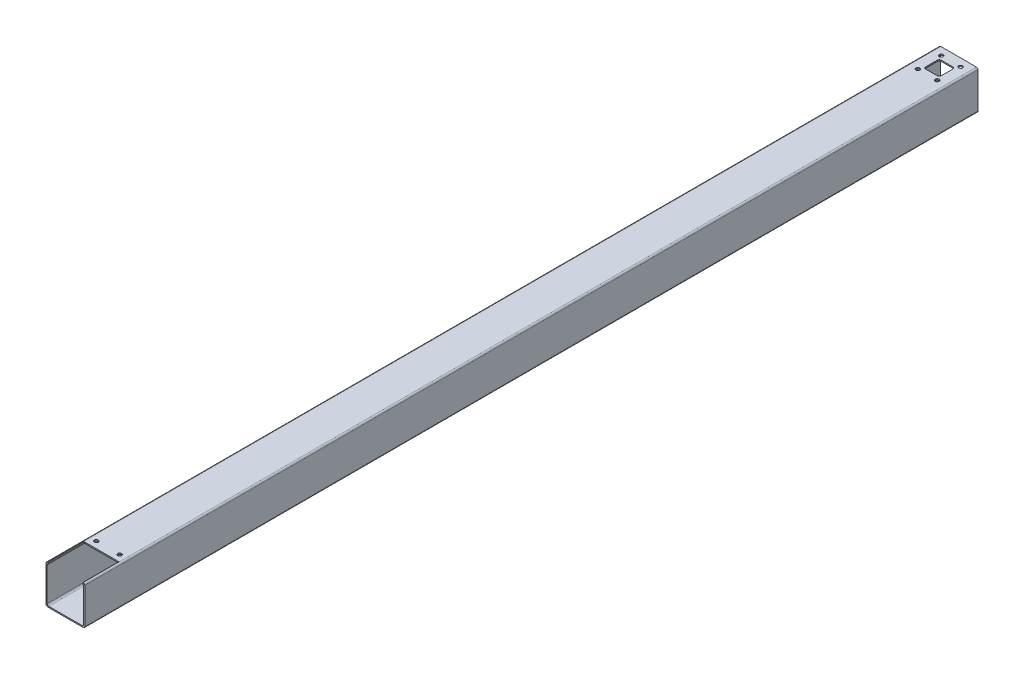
from build123d import *

# Parameters (mm, degrees)
ESQUISSE1_W             = 100
ESQUISSE1_H             = 100
ESQUISSE1_W_2           = 94
ESQUISSE1_H_2           = 94
EXTRU_MINCE1_DEPTH      = 2304
CONG_1_R                = 4
ESQUISSE2_R             = 5
ESQUISSE2_W             = 90
ESQUISSE2_H             = 93
ESQUISSE2_W_2           = 40
ESQUISSE2_H_2           = 40
ENL_V_MAT_EXTRU_1_DEPTH = 10
CONG_2_R                = 5


with BuildPart() as part:
    # Esquisse1 → Extru.-Mince1 (new body)
    with BuildSketch(Plane.XY):
        with Locations((50, 50)):
            Rectangle(ESQUISSE1_W, ESQUISSE1_H)
        with Locations((50, 50)):
            Rectangle(ESQUISSE1_W_2, ESQUISSE1_H_2, mode=Mode.SUBTRACT)
    extrude(amount=EXTRU_MINCE1_DEPTH)

    # Cong_1
    cong_1_edges = [part.edges().sort_by_distance(p)[0] for p in [
        (3, 97, 1152),
        (3, 3, 1152),
        (97, 3, 1152),
        (97, 97, 1152),
        (0, 100, 1152),
        (100, 100, 1152),
        (100, 0, 1152),
        (0, 0, 1152),
    ]]
    fillet(cong_1_edges, radius=CONG_1_R)

    # Esquisse2 → Enl_v. mat.-Extru.1 (cut)
    with BuildSketch(Plane(origin=(0, 100, 0), x_dir=(1, 0, 0), z_dir=(0, 1, 0))):
        with Locations(Location((20, -2194, 0), (0, 0, 270))):
            Circle(ESQUISSE2_R)
        with Locations(Location((80, -2194, 0), (0, 0, 270))):
            Circle(ESQUISSE2_R)
        with Locations(Location((25, -80, 0), (0, 0, 270))):
            Circle(ESQUISSE2_R)
        with Locations(Location((75, -80, 0), (0, 0, 270))):
            Circle(ESQUISSE2_R)
        with Locations(Location((75, -20, 0), (0, 0, 270))):
            Circle(ESQUISSE2_R)
        with Locations(Location((25, -20, 0), (0, 0, 270))):
            Circle(ESQUISSE2_R)
        with Locations((50, -2257.5)):
            Rectangle(ESQUISSE2_W, ESQUISSE2_H)
        with Locations((50, -50)):
            Rectangle(ESQUISSE2_W_2, ESQUISSE2_H_2)
    extrude(amount=-ENL_V_MAT_EXTRU_1_DEPTH, mode=Mode.SUBTRACT)

    # Cong_2
    cong_2_edges = [part.edges().sort_by_distance(p)[0] for p in [
        (70, 98.5, 30),
        (70, 98.5, 70),
        (30, 98.5, 70),
        (30, 98.5, 30),
    ]]
    fillet(cong_2_edges, radius=CONG_2_R)


solid = part.part
